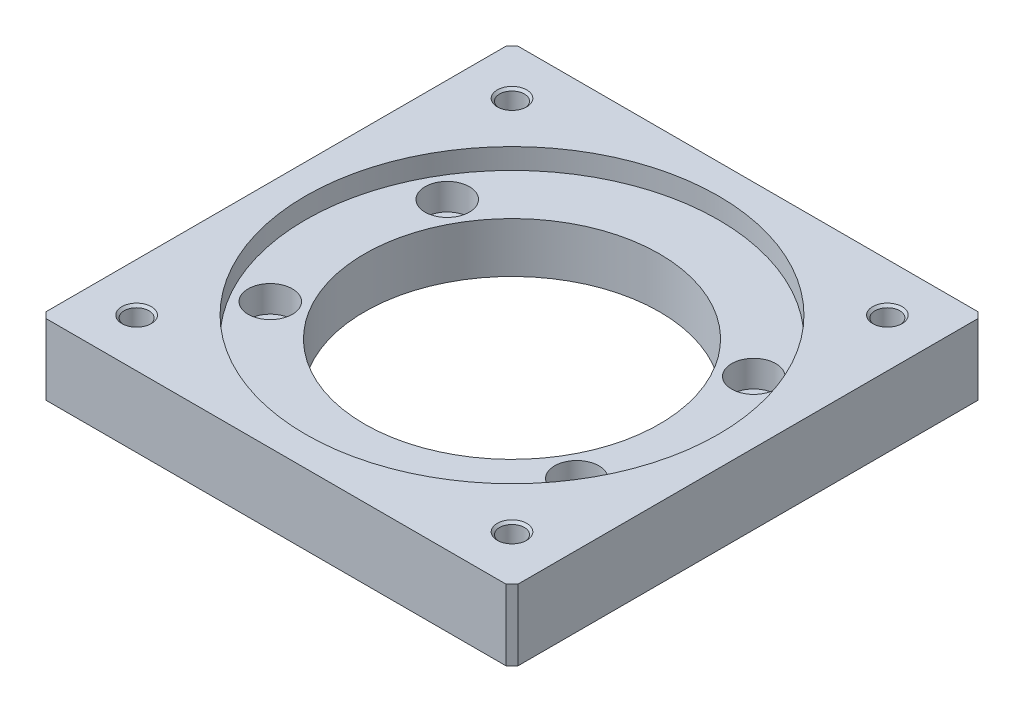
ISO-10303-21;
HEADER;
FILE_DESCRIPTION(('STEP AP214'),'2;1');
FILE_NAME('part.step','',(''),(''),'','','');
FILE_SCHEMA(('AUTOMOTIVE_DESIGN { 1 0 10303 214 1 1 1 1 }'));
ENDSEC;
DATA;
#1=APPLICATION_CONTEXT('core data for automotive mechanical design processes');
#2=APPLICATION_PROTOCOL_DEFINITION('international standard','automotive_design',2000,#1);
#3=PRODUCT_CONTEXT('',#1,'mechanical');
#4=PRODUCT('Part','Part','',(#3));
#5=PRODUCT_RELATED_PRODUCT_CATEGORY('part','',(#4));
#6=PRODUCT_DEFINITION_FORMATION('','',#4);
#7=PRODUCT_DEFINITION_CONTEXT('part definition',#1,'design');
#8=PRODUCT_DEFINITION('design','',#6,#7);
#9=PRODUCT_DEFINITION_SHAPE('','',#8);
#10=(LENGTH_UNIT() NAMED_UNIT(*) SI_UNIT(.MILLI.,.METRE.));
#11=(NAMED_UNIT(*) PLANE_ANGLE_UNIT() SI_UNIT($,.RADIAN.));
#12=(NAMED_UNIT(*) SI_UNIT($,.STERADIAN.) SOLID_ANGLE_UNIT());
#13=UNCERTAINTY_MEASURE_WITH_UNIT(LENGTH_MEASURE(1.E-05),#10,'distance_accuracy_value','');
#14=(GEOMETRIC_REPRESENTATION_CONTEXT(3) GLOBAL_UNCERTAINTY_ASSIGNED_CONTEXT((#13)) GLOBAL_UNIT_ASSIGNED_CONTEXT((#10,
#11,#12)) REPRESENTATION_CONTEXT('',''));
#15=CARTESIAN_POINT('',(0.,0.,0.));
#16=DIRECTION('',(0.,0.,1.));
#17=DIRECTION('',(1.,0.,0.));
#18=AXIS2_PLACEMENT_3D('',#15,#16,#17);
#19=CARTESIAN_POINT('',(-31.81980515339,11.6,31.81980515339));
#20=DIRECTION('',(0.,1.,0.));
#21=DIRECTION('',(0.,0.,1.));
#22=AXIS2_PLACEMENT_3D('',#19,#20,#21);
#23=CONICAL_SURFACE('',#22,2.1,0.785398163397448);
#24=CARTESIAN_POINT('',(-31.81980515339,11.6,31.81980515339));
#25=DIRECTION('',(0.,1.,0.));
#26=DIRECTION('',(1.,0.,0.));
#27=AXIS2_PLACEMENT_3D('',#24,#25,#26);
#28=CIRCLE('',#27,2.1);
#29=CARTESIAN_POINT('',(-29.71980515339,11.6,31.81980515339));
#30=VERTEX_POINT('',#29);
#31=EDGE_CURVE('E181',#30,#30,#28,.F.);
#32=ORIENTED_EDGE('',*,*,#31,.T.);
#33=EDGE_LOOP('',(#32));
#34=FACE_BOUND('',#33,.T.);
#35=CARTESIAN_POINT('',(-31.81980515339,12.,31.81980515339));
#36=DIRECTION('',(0.,1.,0.));
#37=DIRECTION('',(0.,0.,1.));
#38=AXIS2_PLACEMENT_3D('',#35,#36,#37);
#39=CIRCLE('',#38,2.5);
#40=CARTESIAN_POINT('',(-31.81980515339,12.,34.31980515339));
#41=VERTEX_POINT('',#40);
#42=EDGE_CURVE('E188',#41,#41,#39,.T.);
#43=ORIENTED_EDGE('',*,*,#42,.T.);
#44=EDGE_LOOP('',(#43));
#45=FACE_BOUND('',#44,.T.);
#46=ADVANCED_FACE('F16',(#34,#45),#23,.F.);
#47=CARTESIAN_POINT('',(31.81980515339,11.6,31.81980515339));
#48=DIRECTION('',(0.,1.,0.));
#49=DIRECTION('',(0.,0.,1.));
#50=AXIS2_PLACEMENT_3D('',#47,#48,#49);
#51=CONICAL_SURFACE('',#50,2.1,0.785398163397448);
#52=CARTESIAN_POINT('',(31.81980515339,11.6,31.81980515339));
#53=DIRECTION('',(0.,1.,0.));
#54=DIRECTION('',(1.,0.,0.));
#55=AXIS2_PLACEMENT_3D('',#52,#53,#54);
#56=CIRCLE('',#55,2.09999999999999);
#57=CARTESIAN_POINT('',(33.91980515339,11.6,31.81980515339));
#58=VERTEX_POINT('',#57);
#59=EDGE_CURVE('E241',#58,#58,#56,.F.);
#60=ORIENTED_EDGE('',*,*,#59,.T.);
#61=EDGE_LOOP('',(#60));
#62=FACE_BOUND('',#61,.T.);
#63=CARTESIAN_POINT('',(31.81980515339,12.,31.81980515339));
#64=DIRECTION('',(0.,1.,0.));
#65=DIRECTION('',(-1.,0.,0.));
#66=AXIS2_PLACEMENT_3D('',#63,#64,#65);
#67=CIRCLE('',#66,2.5);
#68=CARTESIAN_POINT('',(29.31980515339,12.,31.81980515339));
#69=VERTEX_POINT('',#68);
#70=EDGE_CURVE('E185',#69,#69,#67,.T.);
#71=ORIENTED_EDGE('',*,*,#70,.T.);
#72=EDGE_LOOP('',(#71));
#73=FACE_BOUND('',#72,.T.);
#74=ADVANCED_FACE('F342',(#62,#73),#51,.F.);
#75=CARTESIAN_POINT('',(31.81980515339,11.5999999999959,-31.81980515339));
#76=DIRECTION('',(0.,1.,0.));
#77=DIRECTION('',(0.,0.,1.));
#78=AXIS2_PLACEMENT_3D('',#75,#76,#77);
#79=CONICAL_SURFACE('',#78,2.10000000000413,0.785398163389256);
#80=CARTESIAN_POINT('',(31.81980515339,11.6,-31.81980515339));
#81=DIRECTION('',(0.,1.,0.));
#82=DIRECTION('',(1.,0.,0.));
#83=AXIS2_PLACEMENT_3D('',#80,#81,#82);
#84=CIRCLE('',#83,2.09999999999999);
#85=CARTESIAN_POINT('',(33.91980515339,11.6,-31.81980515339));
#86=VERTEX_POINT('',#85);
#87=EDGE_CURVE('E238',#86,#86,#84,.F.);
#88=ORIENTED_EDGE('',*,*,#87,.T.);
#89=EDGE_LOOP('',(#88));
#90=FACE_BOUND('',#89,.T.);
#91=CARTESIAN_POINT('',(31.81980515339,11.9999999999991,-31.81980515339));
#92=DIRECTION('',(0.,1.,0.));
#93=DIRECTION('',(0.,0.,1.));
#94=AXIS2_PLACEMENT_3D('',#91,#92,#93);
#95=CIRCLE('',#94,2.50000000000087);
#96=CARTESIAN_POINT('',(31.81980515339,11.9999999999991,-29.3198051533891));
#97=VERTEX_POINT('',#96);
#98=EDGE_CURVE('E191',#97,#97,#95,.T.);
#99=ORIENTED_EDGE('',*,*,#98,.T.);
#100=EDGE_LOOP('',(#99));
#101=FACE_BOUND('',#100,.T.);
#102=ADVANCED_FACE('F346',(#90,#101),#79,.F.);
#103=CARTESIAN_POINT('',(-31.81980515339,11.5999999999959,-31.81980515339));
#104=DIRECTION('',(0.,1.,0.));
#105=DIRECTION('',(0.,0.,1.));
#106=AXIS2_PLACEMENT_3D('',#103,#104,#105);
#107=CONICAL_SURFACE('',#106,2.10000000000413,0.785398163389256);
#108=CARTESIAN_POINT('',(-31.81980515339,11.6,-31.81980515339));
#109=DIRECTION('',(0.,1.,0.));
#110=DIRECTION('',(1.,0.,0.));
#111=AXIS2_PLACEMENT_3D('',#108,#109,#110);
#112=CIRCLE('',#111,2.1);
#113=CARTESIAN_POINT('',(-29.71980515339,11.6,-31.81980515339));
#114=VERTEX_POINT('',#113);
#115=EDGE_CURVE('E177',#114,#114,#112,.F.);
#116=ORIENTED_EDGE('',*,*,#115,.T.);
#117=EDGE_LOOP('',(#116));
#118=FACE_BOUND('',#117,.T.);
#119=CARTESIAN_POINT('',(-31.81980515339,11.9999999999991,-31.81980515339));
#120=DIRECTION('',(0.,1.,0.));
#121=DIRECTION('',(-1.,0.,0.));
#122=AXIS2_PLACEMENT_3D('',#119,#120,#121);
#123=CIRCLE('',#122,2.50000000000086);
#124=CARTESIAN_POINT('',(-34.3198051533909,11.9999999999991,-31.81980515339));
#125=VERTEX_POINT('',#124);
#126=EDGE_CURVE('E178',#125,#125,#123,.T.);
#127=ORIENTED_EDGE('',*,*,#126,.T.);
#128=EDGE_LOOP('',(#127));
#129=FACE_BOUND('',#128,.T.);
#130=ADVANCED_FACE('F350',(#118,#129),#107,.F.);
#131=CARTESIAN_POINT('',(0.,8.5,0.));
#132=DIRECTION('',(0.,1.,0.));
#133=DIRECTION('',(0.,0.,1.));
#134=AXIS2_PLACEMENT_3D('',#131,#132,#133);
#135=CYLINDRICAL_SURFACE('',#134,35.);
#136=CARTESIAN_POINT('',(0.,8.5,0.));
#137=DIRECTION('',(0.,1.,0.));
#138=DIRECTION('',(0.,0.,1.));
#139=AXIS2_PLACEMENT_3D('',#136,#137,#138);
#140=CIRCLE('',#139,35.);
#141=CARTESIAN_POINT('',(0.,8.5,35.));
#142=VERTEX_POINT('',#141);
#143=EDGE_CURVE('E162',#142,#142,#140,.F.);
#144=ORIENTED_EDGE('',*,*,#143,.T.);
#145=EDGE_LOOP('',(#144));
#146=FACE_BOUND('',#145,.T.);
#147=CARTESIAN_POINT('',(0.,12.,0.));
#148=DIRECTION('',(0.,1.,0.));
#149=DIRECTION('',(0.,0.,1.));
#150=AXIS2_PLACEMENT_3D('',#147,#148,#149);
#151=CIRCLE('',#150,35.);
#152=CARTESIAN_POINT('',(0.,12.,35.));
#153=VERTEX_POINT('',#152);
#154=EDGE_CURVE('E182',#153,#153,#151,.T.);
#155=ORIENTED_EDGE('',*,*,#154,.T.);
#156=EDGE_LOOP('',(#155));
#157=FACE_BOUND('',#156,.T.);
#158=ADVANCED_FACE('F354',(#146,#157),#135,.F.);
#159=CARTESIAN_POINT('',(25.98076211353,4.,-15.));
#160=DIRECTION('',(0.,1.,0.));
#161=DIRECTION('',(0.,0.,1.));
#162=AXIS2_PLACEMENT_3D('',#159,#160,#161);
#163=CYLINDRICAL_SURFACE('',#162,3.75);
#164=CARTESIAN_POINT('',(25.98076211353,8.5,-15.));
#165=DIRECTION('',(0.,1.,0.));
#166=DIRECTION('',(0.,0.,1.));
#167=AXIS2_PLACEMENT_3D('',#164,#165,#166);
#168=CIRCLE('',#167,3.75);
#169=CARTESIAN_POINT('',(25.98076211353,8.5,-11.25));
#170=VERTEX_POINT('',#169);
#171=EDGE_CURVE('E159',#170,#170,#168,.T.);
#172=ORIENTED_EDGE('',*,*,#171,.T.);
#173=EDGE_LOOP('',(#172));
#174=FACE_BOUND('',#173,.T.);
#175=CARTESIAN_POINT('',(25.98076211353,4.,-15.));
#176=DIRECTION('',(0.,1.,0.));
#177=DIRECTION('',(0.,0.,1.));
#178=AXIS2_PLACEMENT_3D('',#175,#176,#177);
#179=CIRCLE('',#178,3.75);
#180=CARTESIAN_POINT('',(25.98076211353,4.,-11.25));
#181=VERTEX_POINT('',#180);
#182=EDGE_CURVE('E174',#181,#181,#179,.F.);
#183=ORIENTED_EDGE('',*,*,#182,.T.);
#184=EDGE_LOOP('',(#183));
#185=FACE_BOUND('',#184,.T.);
#186=ADVANCED_FACE('F358',(#174,#185),#163,.F.);
#187=CARTESIAN_POINT('',(-25.98076211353,4.,-15.));
#188=DIRECTION('',(0.,1.,0.));
#189=DIRECTION('',(0.,0.,1.));
#190=AXIS2_PLACEMENT_3D('',#187,#188,#189);
#191=CYLINDRICAL_SURFACE('',#190,3.75);
#192=CARTESIAN_POINT('',(-25.98076211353,8.5,-15.));
#193=DIRECTION('',(0.,1.,0.));
#194=DIRECTION('',(0.,0.,1.));
#195=AXIS2_PLACEMENT_3D('',#192,#193,#194);
#196=CIRCLE('',#195,3.75);
#197=CARTESIAN_POINT('',(-25.98076211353,8.5,-11.25));
#198=VERTEX_POINT('',#197);
#199=EDGE_CURVE('E156',#198,#198,#196,.T.);
#200=ORIENTED_EDGE('',*,*,#199,.T.);
#201=EDGE_LOOP('',(#200));
#202=FACE_BOUND('',#201,.T.);
#203=CARTESIAN_POINT('',(-25.98076211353,4.,-15.));
#204=DIRECTION('',(0.,1.,0.));
#205=DIRECTION('',(0.,0.,1.));
#206=AXIS2_PLACEMENT_3D('',#203,#204,#205);
#207=CIRCLE('',#206,3.75);
#208=CARTESIAN_POINT('',(-25.98076211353,4.,-11.25));
#209=VERTEX_POINT('',#208);
#210=EDGE_CURVE('E168',#209,#209,#207,.F.);
#211=ORIENTED_EDGE('',*,*,#210,.T.);
#212=EDGE_LOOP('',(#211));
#213=FACE_BOUND('',#212,.T.);
#214=ADVANCED_FACE('F362',(#202,#213),#191,.F.);
#215=CARTESIAN_POINT('',(-25.98076211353,4.,15.));
#216=DIRECTION('',(0.,1.,0.));
#217=DIRECTION('',(0.,0.,1.));
#218=AXIS2_PLACEMENT_3D('',#215,#216,#217);
#219=CYLINDRICAL_SURFACE('',#218,3.75);
#220=CARTESIAN_POINT('',(-25.98076211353,8.5,15.));
#221=DIRECTION('',(0.,1.,0.));
#222=DIRECTION('',(0.,0.,1.));
#223=AXIS2_PLACEMENT_3D('',#220,#221,#222);
#224=CIRCLE('',#223,3.75);
#225=CARTESIAN_POINT('',(-25.98076211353,8.5,18.75));
#226=VERTEX_POINT('',#225);
#227=EDGE_CURVE('E104',#226,#226,#224,.T.);
#228=ORIENTED_EDGE('',*,*,#227,.T.);
#229=EDGE_LOOP('',(#228));
#230=FACE_BOUND('',#229,.T.);
#231=CARTESIAN_POINT('',(-25.98076211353,4.,15.));
#232=DIRECTION('',(0.,1.,0.));
#233=DIRECTION('',(0.,0.,1.));
#234=AXIS2_PLACEMENT_3D('',#231,#232,#233);
#235=CIRCLE('',#234,3.75);
#236=CARTESIAN_POINT('',(-25.98076211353,4.,18.75));
#237=VERTEX_POINT('',#236);
#238=EDGE_CURVE('E165',#237,#237,#235,.F.);
#239=ORIENTED_EDGE('',*,*,#238,.T.);
#240=EDGE_LOOP('',(#239));
#241=FACE_BOUND('',#240,.T.);
#242=ADVANCED_FACE('F366',(#230,#241),#219,.F.);
#243=CARTESIAN_POINT('',(25.98076211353,4.,15.));
#244=DIRECTION('',(0.,1.,0.));
#245=DIRECTION('',(0.,0.,1.));
#246=AXIS2_PLACEMENT_3D('',#243,#244,#245);
#247=CYLINDRICAL_SURFACE('',#246,3.75);
#248=CARTESIAN_POINT('',(25.98076211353,8.5,15.));
#249=DIRECTION('',(0.,1.,0.));
#250=DIRECTION('',(0.,0.,1.));
#251=AXIS2_PLACEMENT_3D('',#248,#249,#250);
#252=CIRCLE('',#251,3.75);
#253=CARTESIAN_POINT('',(25.98076211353,8.5,18.75));
#254=VERTEX_POINT('',#253);
#255=EDGE_CURVE('E101',#254,#254,#252,.T.);
#256=ORIENTED_EDGE('',*,*,#255,.T.);
#257=EDGE_LOOP('',(#256));
#258=FACE_BOUND('',#257,.T.);
#259=CARTESIAN_POINT('',(25.98076211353,4.,15.));
#260=DIRECTION('',(0.,1.,0.));
#261=DIRECTION('',(0.,0.,1.));
#262=AXIS2_PLACEMENT_3D('',#259,#260,#261);
#263=CIRCLE('',#262,3.75);
#264=CARTESIAN_POINT('',(25.98076211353,4.,18.75));
#265=VERTEX_POINT('',#264);
#266=EDGE_CURVE('E171',#265,#265,#263,.F.);
#267=ORIENTED_EDGE('',*,*,#266,.T.);
#268=EDGE_LOOP('',(#267));
#269=FACE_BOUND('',#268,.T.);
#270=ADVANCED_FACE('F339',(#258,#269),#247,.F.);
#271=CARTESIAN_POINT('',(-40.1056,12.24,-38.8944));
#272=DIRECTION('',(-0.707106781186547,0.,-0.707106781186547));
#273=DIRECTION('',(0.707106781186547,0.,-0.707106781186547));
#274=AXIS2_PLACEMENT_3D('',#271,#272,#273);
#275=PLANE('',#274);
#276=DIRECTION('',(0.707106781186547,0.,-0.707106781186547));
#277=VECTOR('',#276,1.);
#278=CARTESIAN_POINT('',(-40.1056,12.,-38.8944));
#279=LINE('',#278,#277);
#280=CARTESIAN_POINT('',(-40.,12.,-39.));
#281=VERTEX_POINT('',#280);
#282=CARTESIAN_POINT('',(-39.,12.,-40.));
#283=VERTEX_POINT('',#282);
#284=EDGE_CURVE('E194',#281,#283,#279,.T.);
#285=ORIENTED_EDGE('',*,*,#284,.T.);
#286=DIRECTION('',(0.,1.,0.));
#287=VECTOR('',#286,1.);
#288=CARTESIAN_POINT('',(-39.,6.,-40.));
#289=LINE('',#288,#287);
#290=CARTESIAN_POINT('',(-39.,0.,-40.));
#291=VERTEX_POINT('',#290);
#292=EDGE_CURVE('E97',#283,#291,#289,.F.);
#293=ORIENTED_EDGE('',*,*,#292,.T.);
#294=DIRECTION('',(-0.707106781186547,0.,0.707106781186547));
#295=VECTOR('',#294,1.);
#296=CARTESIAN_POINT('',(-39.5,0.,-39.5));
#297=LINE('',#296,#295);
#298=CARTESIAN_POINT('',(-40.,0.,-39.));
#299=VERTEX_POINT('',#298);
#300=EDGE_CURVE('E234',#299,#291,#297,.F.);
#301=ORIENTED_EDGE('',*,*,#300,.F.);
#302=DIRECTION('',(0.,-1.,0.));
#303=VECTOR('',#302,1.);
#304=CARTESIAN_POINT('',(-40.,6.,-39.));
#305=LINE('',#304,#303);
#306=EDGE_CURVE('E247',#299,#281,#305,.F.);
#307=ORIENTED_EDGE('',*,*,#306,.T.);
#308=EDGE_LOOP('',(#285,#293,#301,#307));
#309=FACE_BOUND('',#308,.T.);
#310=ADVANCED_FACE('F250',(#309),#275,.T.);
#311=CARTESIAN_POINT('',(-38.8944,12.24,40.1056));
#312=DIRECTION('',(-0.707106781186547,0.,0.707106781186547));
#313=DIRECTION('',(-0.707106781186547,0.,-0.707106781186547));
#314=AXIS2_PLACEMENT_3D('',#311,#312,#313);
#315=PLANE('',#314);
#316=DIRECTION('',(-0.707106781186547,0.,-0.707106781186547));
#317=VECTOR('',#316,1.);
#318=CARTESIAN_POINT('',(-38.8944,12.,40.1056));
#319=LINE('',#318,#317);
#320=CARTESIAN_POINT('',(-39.,12.,40.));
#321=VERTEX_POINT('',#320);
#322=CARTESIAN_POINT('',(-40.,12.,39.));
#323=VERTEX_POINT('',#322);
#324=EDGE_CURVE('E196',#321,#323,#319,.T.);
#325=ORIENTED_EDGE('',*,*,#324,.T.);
#326=DIRECTION('',(0.,1.,0.));
#327=VECTOR('',#326,1.);
#328=CARTESIAN_POINT('',(-40.,6.,39.));
#329=LINE('',#328,#327);
#330=CARTESIAN_POINT('',(-40.,0.,39.));
#331=VERTEX_POINT('',#330);
#332=EDGE_CURVE('E212',#323,#331,#329,.F.);
#333=ORIENTED_EDGE('',*,*,#332,.T.);
#334=DIRECTION('',(0.707106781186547,0.,0.707106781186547));
#335=VECTOR('',#334,1.);
#336=CARTESIAN_POINT('',(-39.5,0.,39.5));
#337=LINE('',#336,#335);
#338=CARTESIAN_POINT('',(-39.,0.,40.));
#339=VERTEX_POINT('',#338);
#340=EDGE_CURVE('E232',#339,#331,#337,.F.);
#341=ORIENTED_EDGE('',*,*,#340,.F.);
#342=DIRECTION('',(0.,-1.,0.));
#343=VECTOR('',#342,1.);
#344=CARTESIAN_POINT('',(-39.,6.,40.));
#345=LINE('',#344,#343);
#346=EDGE_CURVE('E210',#339,#321,#345,.F.);
#347=ORIENTED_EDGE('',*,*,#346,.T.);
#348=EDGE_LOOP('',(#325,#333,#341,#347));
#349=FACE_BOUND('',#348,.T.);
#350=ADVANCED_FACE('F333',(#349),#315,.T.);
#351=CARTESIAN_POINT('',(38.8944,12.24,-40.1056));
#352=DIRECTION('',(0.707106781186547,0.,-0.707106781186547));
#353=DIRECTION('',(0.707106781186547,0.,0.707106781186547));
#354=AXIS2_PLACEMENT_3D('',#351,#352,#353);
#355=PLANE('',#354);
#356=DIRECTION('',(0.707106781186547,0.,0.707106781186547));
#357=VECTOR('',#356,1.);
#358=CARTESIAN_POINT('',(38.8944,12.,-40.1056));
#359=LINE('',#358,#357);
#360=CARTESIAN_POINT('',(39.,12.,-40.));
#361=VERTEX_POINT('',#360);
#362=CARTESIAN_POINT('',(40.,12.,-39.));
#363=VERTEX_POINT('',#362);
#364=EDGE_CURVE('E20',#361,#363,#359,.T.);
#365=ORIENTED_EDGE('',*,*,#364,.T.);
#366=DIRECTION('',(0.,1.,0.));
#367=VECTOR('',#366,1.);
#368=CARTESIAN_POINT('',(40.,6.,-39.));
#369=LINE('',#368,#367);
#370=CARTESIAN_POINT('',(40.,0.,-39.));
#371=VERTEX_POINT('',#370);
#372=EDGE_CURVE('E110',#363,#371,#369,.F.);
#373=ORIENTED_EDGE('',*,*,#372,.T.);
#374=DIRECTION('',(-0.707106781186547,0.,-0.707106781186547));
#375=VECTOR('',#374,1.);
#376=CARTESIAN_POINT('',(39.5,0.,-39.5));
#377=LINE('',#376,#375);
#378=CARTESIAN_POINT('',(39.,0.,-40.));
#379=VERTEX_POINT('',#378);
#380=EDGE_CURVE('E100',#379,#371,#377,.F.);
#381=ORIENTED_EDGE('',*,*,#380,.F.);
#382=DIRECTION('',(0.,-1.,0.));
#383=VECTOR('',#382,1.);
#384=CARTESIAN_POINT('',(39.,6.,-40.));
#385=LINE('',#384,#383);
#386=EDGE_CURVE('E94',#379,#361,#385,.F.);
#387=ORIENTED_EDGE('',*,*,#386,.T.);
#388=EDGE_LOOP('',(#365,#373,#381,#387));
#389=FACE_BOUND('',#388,.T.);
#390=ADVANCED_FACE('F99',(#389),#355,.T.);
#391=CARTESIAN_POINT('',(40.1056,12.24,38.8944));
#392=DIRECTION('',(0.707106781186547,0.,0.707106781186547));
#393=DIRECTION('',(-0.707106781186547,0.,0.707106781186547));
#394=AXIS2_PLACEMENT_3D('',#391,#392,#393);
#395=PLANE('',#394);
#396=DIRECTION('',(-0.707106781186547,0.,0.707106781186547));
#397=VECTOR('',#396,1.);
#398=CARTESIAN_POINT('',(40.1056,12.,38.8944));
#399=LINE('',#398,#397);
#400=CARTESIAN_POINT('',(40.,12.,39.));
#401=VERTEX_POINT('',#400);
#402=CARTESIAN_POINT('',(39.,12.,40.));
#403=VERTEX_POINT('',#402);
#404=EDGE_CURVE('E88',#401,#403,#399,.T.);
#405=ORIENTED_EDGE('',*,*,#404,.T.);
#406=DIRECTION('',(0.,1.,0.));
#407=VECTOR('',#406,1.);
#408=CARTESIAN_POINT('',(39.,6.,40.));
#409=LINE('',#408,#407);
#410=CARTESIAN_POINT('',(39.,0.,40.));
#411=VERTEX_POINT('',#410);
#412=EDGE_CURVE('E108',#403,#411,#409,.F.);
#413=ORIENTED_EDGE('',*,*,#412,.T.);
#414=DIRECTION('',(0.707106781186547,0.,-0.707106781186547));
#415=VECTOR('',#414,1.);
#416=CARTESIAN_POINT('',(39.5,0.,39.5));
#417=LINE('',#416,#415);
#418=CARTESIAN_POINT('',(40.,0.,39.));
#419=VERTEX_POINT('',#418);
#420=EDGE_CURVE('E35',#419,#411,#417,.F.);
#421=ORIENTED_EDGE('',*,*,#420,.F.);
#422=DIRECTION('',(0.,-1.,0.));
#423=VECTOR('',#422,1.);
#424=CARTESIAN_POINT('',(40.,6.,39.));
#425=LINE('',#424,#423);
#426=EDGE_CURVE('E111',#419,#401,#425,.F.);
#427=ORIENTED_EDGE('',*,*,#426,.T.);
#428=EDGE_LOOP('',(#405,#413,#421,#427));
#429=FACE_BOUND('',#428,.T.);
#430=ADVANCED_FACE('F198',(#429),#395,.T.);
#431=CARTESIAN_POINT('',(-41.6,12.,41.6));
#432=DIRECTION('',(0.,1.,0.));
#433=DIRECTION('',(1.,0.,0.));
#434=AXIS2_PLACEMENT_3D('',#431,#432,#433);
#435=PLANE('',#434);
#436=ORIENTED_EDGE('',*,*,#126,.F.);
#437=EDGE_LOOP('',(#436));
#438=FACE_BOUND('',#437,.T.);
#439=ORIENTED_EDGE('',*,*,#154,.F.);
#440=EDGE_LOOP('',(#439));
#441=FACE_BOUND('',#440,.T.);
#442=ORIENTED_EDGE('',*,*,#70,.F.);
#443=EDGE_LOOP('',(#442));
#444=FACE_BOUND('',#443,.T.);
#445=ORIENTED_EDGE('',*,*,#42,.F.);
#446=EDGE_LOOP('',(#445));
#447=FACE_BOUND('',#446,.T.);
#448=ORIENTED_EDGE('',*,*,#98,.F.);
#449=EDGE_LOOP('',(#448));
#450=FACE_BOUND('',#449,.T.);
#451=ORIENTED_EDGE('',*,*,#284,.F.);
#452=DIRECTION('',(0.,0.,-1.));
#453=VECTOR('',#452,1.);
#454=CARTESIAN_POINT('',(-40.,12.,0.));
#455=LINE('',#454,#453);
#456=EDGE_CURVE('E218',#281,#323,#455,.F.);
#457=ORIENTED_EDGE('',*,*,#456,.T.);
#458=ORIENTED_EDGE('',*,*,#324,.F.);
#459=DIRECTION('',(-1.,0.,0.));
#460=VECTOR('',#459,1.);
#461=CARTESIAN_POINT('',(0.,12.,40.));
#462=LINE('',#461,#460);
#463=EDGE_CURVE('E205',#321,#403,#462,.F.);
#464=ORIENTED_EDGE('',*,*,#463,.T.);
#465=ORIENTED_EDGE('',*,*,#404,.F.);
#466=DIRECTION('',(0.,0.,1.));
#467=VECTOR('',#466,1.);
#468=CARTESIAN_POINT('',(40.,12.,0.));
#469=LINE('',#468,#467);
#470=EDGE_CURVE('E84',#401,#363,#469,.F.);
#471=ORIENTED_EDGE('',*,*,#470,.T.);
#472=ORIENTED_EDGE('',*,*,#364,.F.);
#473=DIRECTION('',(1.,0.,0.));
#474=VECTOR('',#473,1.);
#475=CARTESIAN_POINT('',(0.,12.,-40.));
#476=LINE('',#475,#474);
#477=EDGE_CURVE('E82',#361,#283,#476,.F.);
#478=ORIENTED_EDGE('',*,*,#477,.T.);
#479=EDGE_LOOP('',(#451,#457,#458,#464,#465,#471,#472,#478));
#480=FACE_BOUND('',#479,.T.);
#481=ADVANCED_FACE('F81',(#438,#441,#444,#447,#450,#480),#435,.T.);
#482=CARTESIAN_POINT('',(-31.81980515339,0.399999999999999,31.81980515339));
#483=DIRECTION('',(0.,1.,0.));
#484=DIRECTION('',(0.,0.,1.));
#485=AXIS2_PLACEMENT_3D('',#482,#483,#484);
#486=CYLINDRICAL_SURFACE('',#485,2.1);
#487=CARTESIAN_POINT('',(-31.81980515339,0.399999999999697,31.81980515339));
#488=DIRECTION('',(0.,-1.,0.));
#489=DIRECTION('',(0.,0.,-1.));
#490=AXIS2_PLACEMENT_3D('',#487,#488,#489);
#491=CIRCLE('',#490,2.0999999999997);
#492=CARTESIAN_POINT('',(-31.81980515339,0.399999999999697,29.7198051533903));
#493=VERTEX_POINT('',#492);
#494=EDGE_CURVE('E219',#493,#493,#491,.T.);
#495=ORIENTED_EDGE('',*,*,#494,.T.);
#496=EDGE_LOOP('',(#495));
#497=FACE_BOUND('',#496,.T.);
#498=ORIENTED_EDGE('',*,*,#31,.F.);
#499=EDGE_LOOP('',(#498));
#500=FACE_BOUND('',#499,.T.);
#501=ADVANCED_FACE('F327',(#497,#500),#486,.F.);
#502=CARTESIAN_POINT('',(31.81980515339,0.399999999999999,31.81980515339));
#503=DIRECTION('',(0.,1.,0.));
#504=DIRECTION('',(0.,0.,1.));
#505=AXIS2_PLACEMENT_3D('',#502,#503,#504);
#506=CYLINDRICAL_SURFACE('',#505,2.09999999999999);
#507=CARTESIAN_POINT('',(31.81980515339,0.399999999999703,31.81980515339));
#508=DIRECTION('',(0.,-1.,0.));
#509=DIRECTION('',(0.,0.,-1.));
#510=AXIS2_PLACEMENT_3D('',#507,#508,#509);
#511=CIRCLE('',#510,2.0999999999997);
#512=CARTESIAN_POINT('',(31.81980515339,0.399999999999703,29.7198051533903));
#513=VERTEX_POINT('',#512);
#514=EDGE_CURVE('E221',#513,#513,#511,.T.);
#515=ORIENTED_EDGE('',*,*,#514,.T.);
#516=EDGE_LOOP('',(#515));
#517=FACE_BOUND('',#516,.T.);
#518=ORIENTED_EDGE('',*,*,#59,.F.);
#519=EDGE_LOOP('',(#518));
#520=FACE_BOUND('',#519,.T.);
#521=ADVANCED_FACE('F376',(#517,#520),#506,.F.);
#522=CARTESIAN_POINT('',(31.81980515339,0.399999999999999,-31.81980515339));
#523=DIRECTION('',(0.,1.,0.));
#524=DIRECTION('',(0.,0.,1.));
#525=AXIS2_PLACEMENT_3D('',#522,#523,#524);
#526=CYLINDRICAL_SURFACE('',#525,2.09999999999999);
#527=CARTESIAN_POINT('',(31.81980515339,0.400000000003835,-31.81980515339));
#528=DIRECTION('',(0.,-1.,0.));
#529=DIRECTION('',(0.,0.,-1.));
#530=AXIS2_PLACEMENT_3D('',#527,#528,#529);
#531=CIRCLE('',#530,2.10000000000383);
#532=CARTESIAN_POINT('',(31.81980515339,0.400000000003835,-33.9198051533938));
#533=VERTEX_POINT('',#532);
#534=EDGE_CURVE('E226',#533,#533,#531,.T.);
#535=ORIENTED_EDGE('',*,*,#534,.T.);
#536=EDGE_LOOP('',(#535));
#537=FACE_BOUND('',#536,.T.);
#538=ORIENTED_EDGE('',*,*,#87,.F.);
#539=EDGE_LOOP('',(#538));
#540=FACE_BOUND('',#539,.T.);
#541=ADVANCED_FACE('F263',(#537,#540),#526,.F.);
#542=CARTESIAN_POINT('',(-31.81980515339,0.399999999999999,-31.81980515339));
#543=DIRECTION('',(0.,1.,0.));
#544=DIRECTION('',(0.,0.,1.));
#545=AXIS2_PLACEMENT_3D('',#542,#543,#544);
#546=CYLINDRICAL_SURFACE('',#545,2.1);
#547=CARTESIAN_POINT('',(-31.81980515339,0.400000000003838,-31.81980515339));
#548=DIRECTION('',(0.,-1.,0.));
#549=DIRECTION('',(0.,0.,-1.));
#550=AXIS2_PLACEMENT_3D('',#547,#548,#549);
#551=CIRCLE('',#550,2.10000000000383);
#552=CARTESIAN_POINT('',(-31.81980515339,0.400000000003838,-33.9198051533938));
#553=VERTEX_POINT('',#552);
#554=EDGE_CURVE('E152',#553,#553,#551,.T.);
#555=ORIENTED_EDGE('',*,*,#554,.T.);
#556=EDGE_LOOP('',(#555));
#557=FACE_BOUND('',#556,.T.);
#558=ORIENTED_EDGE('',*,*,#115,.F.);
#559=EDGE_LOOP('',(#558));
#560=FACE_BOUND('',#559,.T.);
#561=ADVANCED_FACE('F323',(#557,#560),#546,.F.);
#562=CARTESIAN_POINT('',(-30.91999259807,4.,19.5));
#563=DIRECTION('',(0.,1.,0.));
#564=DIRECTION('',(1.,0.,0.));
#565=AXIS2_PLACEMENT_3D('',#562,#563,#564);
#566=PLANE('',#565);
#567=CARTESIAN_POINT('',(25.98076211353,4.,-15.));
#568=DIRECTION('',(0.,1.,0.));
#569=DIRECTION('',(0.,0.,1.));
#570=AXIS2_PLACEMENT_3D('',#567,#568,#569);
#571=CIRCLE('',#570,2.25);
#572=CARTESIAN_POINT('',(25.98076211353,4.,-12.75));
#573=VERTEX_POINT('',#572);
#574=EDGE_CURVE('E150',#573,#573,#571,.F.);
#575=ORIENTED_EDGE('',*,*,#574,.T.);
#576=EDGE_LOOP('',(#575));
#577=FACE_BOUND('',#576,.T.);
#578=ORIENTED_EDGE('',*,*,#182,.F.);
#579=EDGE_LOOP('',(#578));
#580=FACE_BOUND('',#579,.T.);
#581=ADVANCED_FACE('F319',(#577,#580),#566,.T.);
#582=CARTESIAN_POINT('',(-30.91999259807,4.,19.5));
#583=DIRECTION('',(0.,1.,0.));
#584=DIRECTION('',(1.,0.,0.));
#585=AXIS2_PLACEMENT_3D('',#582,#583,#584);
#586=PLANE('',#585);
#587=CARTESIAN_POINT('',(25.98076211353,4.,15.));
#588=DIRECTION('',(0.,1.,0.));
#589=DIRECTION('',(0.,0.,1.));
#590=AXIS2_PLACEMENT_3D('',#587,#588,#589);
#591=CIRCLE('',#590,2.25);
#592=CARTESIAN_POINT('',(25.98076211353,4.,17.25));
#593=VERTEX_POINT('',#592);
#594=EDGE_CURVE('E147',#593,#593,#591,.F.);
#595=ORIENTED_EDGE('',*,*,#594,.T.);
#596=EDGE_LOOP('',(#595));
#597=FACE_BOUND('',#596,.T.);
#598=ORIENTED_EDGE('',*,*,#266,.F.);
#599=EDGE_LOOP('',(#598));
#600=FACE_BOUND('',#599,.T.);
#601=ADVANCED_FACE('F315',(#597,#600),#586,.T.);
#602=CARTESIAN_POINT('',(-30.91999259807,4.,19.5));
#603=DIRECTION('',(0.,1.,0.));
#604=DIRECTION('',(1.,0.,0.));
#605=AXIS2_PLACEMENT_3D('',#602,#603,#604);
#606=PLANE('',#605);
#607=CARTESIAN_POINT('',(-25.98076211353,4.,-15.));
#608=DIRECTION('',(0.,1.,0.));
#609=DIRECTION('',(0.,0.,1.));
#610=AXIS2_PLACEMENT_3D('',#607,#608,#609);
#611=CIRCLE('',#610,2.25);
#612=CARTESIAN_POINT('',(-25.98076211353,4.,-12.75));
#613=VERTEX_POINT('',#612);
#614=EDGE_CURVE('E144',#613,#613,#611,.F.);
#615=ORIENTED_EDGE('',*,*,#614,.T.);
#616=EDGE_LOOP('',(#615));
#617=FACE_BOUND('',#616,.T.);
#618=ORIENTED_EDGE('',*,*,#210,.F.);
#619=EDGE_LOOP('',(#618));
#620=FACE_BOUND('',#619,.T.);
#621=ADVANCED_FACE('F311',(#617,#620),#606,.T.);
#622=CARTESIAN_POINT('',(-30.91999259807,4.,19.5));
#623=DIRECTION('',(0.,1.,0.));
#624=DIRECTION('',(1.,0.,0.));
#625=AXIS2_PLACEMENT_3D('',#622,#623,#624);
#626=PLANE('',#625);
#627=CARTESIAN_POINT('',(-25.98076211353,4.,15.));
#628=DIRECTION('',(0.,1.,0.));
#629=DIRECTION('',(0.,0.,1.));
#630=AXIS2_PLACEMENT_3D('',#627,#628,#629);
#631=CIRCLE('',#630,2.25);
#632=CARTESIAN_POINT('',(-25.98076211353,4.,17.25));
#633=VERTEX_POINT('',#632);
#634=EDGE_CURVE('E141',#633,#633,#631,.F.);
#635=ORIENTED_EDGE('',*,*,#634,.T.);
#636=EDGE_LOOP('',(#635));
#637=FACE_BOUND('',#636,.T.);
#638=ORIENTED_EDGE('',*,*,#238,.F.);
#639=EDGE_LOOP('',(#638));
#640=FACE_BOUND('',#639,.T.);
#641=ADVANCED_FACE('F307',(#637,#640),#626,.T.);
#642=CARTESIAN_POINT('',(-36.4,8.5,36.42998007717));
#643=DIRECTION('',(0.,1.,0.));
#644=DIRECTION('',(1.,0.,0.));
#645=AXIS2_PLACEMENT_3D('',#642,#643,#644);
#646=PLANE('',#645);
#647=ORIENTED_EDGE('',*,*,#255,.F.);
#648=EDGE_LOOP('',(#647));
#649=FACE_BOUND('',#648,.T.);
#650=ORIENTED_EDGE('',*,*,#227,.F.);
#651=EDGE_LOOP('',(#650));
#652=FACE_BOUND('',#651,.T.);
#653=ORIENTED_EDGE('',*,*,#199,.F.);
#654=EDGE_LOOP('',(#653));
#655=FACE_BOUND('',#654,.T.);
#656=ORIENTED_EDGE('',*,*,#171,.F.);
#657=EDGE_LOOP('',(#656));
#658=FACE_BOUND('',#657,.T.);
#659=CARTESIAN_POINT('',(0.,8.5,0.));
#660=DIRECTION('',(0.,1.,0.));
#661=DIRECTION('',(0.,0.,1.));
#662=AXIS2_PLACEMENT_3D('',#659,#660,#661);
#663=CIRCLE('',#662,25.);
#664=CARTESIAN_POINT('',(0.,8.5,25.));
#665=VERTEX_POINT('',#664);
#666=EDGE_CURVE('E137',#665,#665,#663,.F.);
#667=ORIENTED_EDGE('',*,*,#666,.T.);
#668=EDGE_LOOP('',(#667));
#669=FACE_BOUND('',#668,.T.);
#670=ORIENTED_EDGE('',*,*,#143,.F.);
#671=EDGE_LOOP('',(#670));
#672=FACE_BOUND('',#671,.T.);
#673=ADVANCED_FACE('F304',(#649,#652,#655,#658,#669,#672),#646,.T.);
#674=CARTESIAN_POINT('',(40.56,-0.24,-40.));
#675=DIRECTION('',(0.,0.,-1.));
#676=DIRECTION('',(-1.,0.,0.));
#677=AXIS2_PLACEMENT_3D('',#674,#675,#676);
#678=PLANE('',#677);
#679=ORIENTED_EDGE('',*,*,#292,.F.);
#680=ORIENTED_EDGE('',*,*,#477,.F.);
#681=ORIENTED_EDGE('',*,*,#386,.F.);
#682=DIRECTION('',(-1.,0.,0.));
#683=VECTOR('',#682,1.);
#684=CARTESIAN_POINT('',(0.,0.,-40.));
#685=LINE('',#684,#683);
#686=EDGE_CURVE('E140',#379,#291,#685,.T.);
#687=ORIENTED_EDGE('',*,*,#686,.T.);
#688=EDGE_LOOP('',(#679,#680,#681,#687));
#689=FACE_BOUND('',#688,.T.);
#690=ADVANCED_FACE('F92',(#689),#678,.T.);
#691=CARTESIAN_POINT('',(-40.,-0.24,-40.56));
#692=DIRECTION('',(-1.,0.,0.));
#693=DIRECTION('',(0.,0.,1.));
#694=AXIS2_PLACEMENT_3D('',#691,#692,#693);
#695=PLANE('',#694);
#696=ORIENTED_EDGE('',*,*,#332,.F.);
#697=ORIENTED_EDGE('',*,*,#456,.F.);
#698=ORIENTED_EDGE('',*,*,#306,.F.);
#699=DIRECTION('',(0.,0.,1.));
#700=VECTOR('',#699,1.);
#701=CARTESIAN_POINT('',(-40.,0.,0.));
#702=LINE('',#701,#700);
#703=EDGE_CURVE('E253',#299,#331,#702,.T.);
#704=ORIENTED_EDGE('',*,*,#703,.T.);
#705=EDGE_LOOP('',(#696,#697,#698,#704));
#706=FACE_BOUND('',#705,.T.);
#707=ADVANCED_FACE('F296',(#706),#695,.T.);
#708=CARTESIAN_POINT('',(-40.56,-0.24,40.));
#709=DIRECTION('',(0.,0.,1.));
#710=DIRECTION('',(1.,0.,0.));
#711=AXIS2_PLACEMENT_3D('',#708,#709,#710);
#712=PLANE('',#711);
#713=ORIENTED_EDGE('',*,*,#412,.F.);
#714=ORIENTED_EDGE('',*,*,#463,.F.);
#715=ORIENTED_EDGE('',*,*,#346,.F.);
#716=DIRECTION('',(1.,0.,0.));
#717=VECTOR('',#716,1.);
#718=CARTESIAN_POINT('',(0.,0.,40.));
#719=LINE('',#718,#717);
#720=EDGE_CURVE('E208',#339,#411,#719,.T.);
#721=ORIENTED_EDGE('',*,*,#720,.T.);
#722=EDGE_LOOP('',(#713,#714,#715,#721));
#723=FACE_BOUND('',#722,.T.);
#724=ADVANCED_FACE('F203',(#723),#712,.T.);
#725=CARTESIAN_POINT('',(40.,-0.24,40.56));
#726=DIRECTION('',(1.,0.,0.));
#727=DIRECTION('',(0.,0.,-1.));
#728=AXIS2_PLACEMENT_3D('',#725,#726,#727);
#729=PLANE('',#728);
#730=ORIENTED_EDGE('',*,*,#426,.F.);
#731=DIRECTION('',(0.,0.,-1.));
#732=VECTOR('',#731,1.);
#733=CARTESIAN_POINT('',(40.,0.,0.));
#734=LINE('',#733,#732);
#735=EDGE_CURVE('E136',#419,#371,#734,.T.);
#736=ORIENTED_EDGE('',*,*,#735,.T.);
#737=ORIENTED_EDGE('',*,*,#372,.F.);
#738=ORIENTED_EDGE('',*,*,#470,.F.);
#739=EDGE_LOOP('',(#730,#736,#737,#738));
#740=FACE_BOUND('',#739,.T.);
#741=ADVANCED_FACE('F286',(#740),#729,.T.);
#742=CARTESIAN_POINT('',(-31.81980515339,0.399999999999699,31.81980515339));
#743=DIRECTION('',(0.,-1.,0.));
#744=DIRECTION('',(0.,0.,-1.));
#745=AXIS2_PLACEMENT_3D('',#742,#743,#744);
#746=CONICAL_SURFACE('',#745,2.09999999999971,0.785398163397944);
#747=ORIENTED_EDGE('',*,*,#494,.F.);
#748=EDGE_LOOP('',(#747));
#749=FACE_BOUND('',#748,.T.);
#750=CARTESIAN_POINT('',(-31.81980515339,0.,31.81980515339));
#751=DIRECTION('',(0.,-1.,0.));
#752=DIRECTION('',(1.,0.,0.));
#753=AXIS2_PLACEMENT_3D('',#750,#751,#752);
#754=CIRCLE('',#753,2.49999999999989);
#755=CARTESIAN_POINT('',(-29.3198051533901,0.,31.81980515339));
#756=VERTEX_POINT('',#755);
#757=EDGE_CURVE('E133',#756,#756,#754,.T.);
#758=ORIENTED_EDGE('',*,*,#757,.T.);
#759=EDGE_LOOP('',(#758));
#760=FACE_BOUND('',#759,.T.);
#761=ADVANCED_FACE('F288',(#749,#760),#746,.F.);
#762=CARTESIAN_POINT('',(31.81980515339,0.399999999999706,31.81980515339));
#763=DIRECTION('',(0.,-1.,0.));
#764=DIRECTION('',(0.,0.,-1.));
#765=AXIS2_PLACEMENT_3D('',#762,#763,#764);
#766=CONICAL_SURFACE('',#765,2.0999999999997,0.785398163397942);
#767=ORIENTED_EDGE('',*,*,#514,.F.);
#768=EDGE_LOOP('',(#767));
#769=FACE_BOUND('',#768,.T.);
#770=CARTESIAN_POINT('',(31.81980515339,0.,31.81980515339));
#771=DIRECTION('',(0.,-1.,0.));
#772=DIRECTION('',(0.,0.,-1.));
#773=AXIS2_PLACEMENT_3D('',#770,#771,#772);
#774=CIRCLE('',#773,2.4999999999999);
#775=CARTESIAN_POINT('',(31.81980515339,0.,29.3198051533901));
#776=VERTEX_POINT('',#775);
#777=EDGE_CURVE('E130',#776,#776,#774,.T.);
#778=ORIENTED_EDGE('',*,*,#777,.T.);
#779=EDGE_LOOP('',(#778));
#780=FACE_BOUND('',#779,.T.);
#781=ADVANCED_FACE('F270',(#769,#780),#766,.F.);
#782=CARTESIAN_POINT('',(31.81980515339,0.400000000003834,-31.81980515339));
#783=DIRECTION('',(0.,-1.,0.));
#784=DIRECTION('',(1.,0.,0.));
#785=AXIS2_PLACEMENT_3D('',#782,#783,#784);
#786=CONICAL_SURFACE('',#785,2.10000000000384,0.785398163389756);
#787=ORIENTED_EDGE('',*,*,#534,.F.);
#788=EDGE_LOOP('',(#787));
#789=FACE_BOUND('',#788,.T.);
#790=CARTESIAN_POINT('',(31.81980515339,7.5764047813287E-13,-31.81980515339));
#791=DIRECTION('',(0.,-1.,0.));
#792=DIRECTION('',(0.,0.,-1.));
#793=AXIS2_PLACEMENT_3D('',#790,#791,#792);
#794=CIRCLE('',#793,2.50000000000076);
#795=CARTESIAN_POINT('',(31.81980515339,7.5764047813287E-13,-34.3198051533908));
#796=VERTEX_POINT('',#795);
#797=EDGE_CURVE('E127',#796,#796,#794,.T.);
#798=ORIENTED_EDGE('',*,*,#797,.T.);
#799=EDGE_LOOP('',(#798));
#800=FACE_BOUND('',#799,.T.);
#801=ADVANCED_FACE('F266',(#789,#800),#786,.F.);
#802=CARTESIAN_POINT('',(-31.81980515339,0.400000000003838,-31.81980515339));
#803=DIRECTION('',(0.,-1.,0.));
#804=DIRECTION('',(0.,0.,-1.));
#805=AXIS2_PLACEMENT_3D('',#802,#803,#804);
#806=CONICAL_SURFACE('',#805,2.10000000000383,0.78539816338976);
#807=ORIENTED_EDGE('',*,*,#554,.F.);
#808=EDGE_LOOP('',(#807));
#809=FACE_BOUND('',#808,.T.);
#810=CARTESIAN_POINT('',(-31.81980515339,7.57694688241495E-13,-31.81980515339));
#811=DIRECTION('',(0.,-1.,0.));
#812=DIRECTION('',(1.,0.,0.));
#813=AXIS2_PLACEMENT_3D('',#810,#811,#812);
#814=CIRCLE('',#813,2.50000000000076);
#815=CARTESIAN_POINT('',(-29.3198051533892,7.57662420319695E-13,-31.81980515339));
#816=VERTEX_POINT('',#815);
#817=EDGE_CURVE('E124',#816,#816,#814,.T.);
#818=ORIENTED_EDGE('',*,*,#817,.T.);
#819=EDGE_LOOP('',(#818));
#820=FACE_BOUND('',#819,.T.);
#821=ADVANCED_FACE('F269',(#809,#820),#806,.F.);
#822=CARTESIAN_POINT('',(25.98076211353,0.,-15.));
#823=DIRECTION('',(0.,1.,0.));
#824=DIRECTION('',(0.,0.,1.));
#825=AXIS2_PLACEMENT_3D('',#822,#823,#824);
#826=CYLINDRICAL_SURFACE('',#825,2.25);
#827=CARTESIAN_POINT('',(25.98076211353,0.,-15.));
#828=DIRECTION('',(0.,1.,0.));
#829=DIRECTION('',(0.,0.,1.));
#830=AXIS2_PLACEMENT_3D('',#827,#828,#829);
#831=CIRCLE('',#830,2.25);
#832=CARTESIAN_POINT('',(25.98076211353,0.,-12.75));
#833=VERTEX_POINT('',#832);
#834=EDGE_CURVE('E121',#833,#833,#831,.F.);
#835=ORIENTED_EDGE('',*,*,#834,.T.);
#836=EDGE_LOOP('',(#835));
#837=FACE_BOUND('',#836,.T.);
#838=ORIENTED_EDGE('',*,*,#574,.F.);
#839=EDGE_LOOP('',(#838));
#840=FACE_BOUND('',#839,.T.);
#841=ADVANCED_FACE('F390',(#837,#840),#826,.F.);
#842=CARTESIAN_POINT('',(25.98076211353,0.,15.));
#843=DIRECTION('',(0.,1.,0.));
#844=DIRECTION('',(0.,0.,1.));
#845=AXIS2_PLACEMENT_3D('',#842,#843,#844);
#846=CYLINDRICAL_SURFACE('',#845,2.25);
#847=CARTESIAN_POINT('',(25.98076211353,0.,15.));
#848=DIRECTION('',(0.,1.,0.));
#849=DIRECTION('',(0.,0.,1.));
#850=AXIS2_PLACEMENT_3D('',#847,#848,#849);
#851=CIRCLE('',#850,2.25);
#852=CARTESIAN_POINT('',(25.98076211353,0.,17.25));
#853=VERTEX_POINT('',#852);
#854=EDGE_CURVE('E118',#853,#853,#851,.F.);
#855=ORIENTED_EDGE('',*,*,#854,.T.);
#856=EDGE_LOOP('',(#855));
#857=FACE_BOUND('',#856,.T.);
#858=ORIENTED_EDGE('',*,*,#594,.F.);
#859=EDGE_LOOP('',(#858));
#860=FACE_BOUND('',#859,.T.);
#861=ADVANCED_FACE('F394',(#857,#860),#846,.F.);
#862=CARTESIAN_POINT('',(-25.98076211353,0.,-15.));
#863=DIRECTION('',(0.,1.,0.));
#864=DIRECTION('',(0.,0.,1.));
#865=AXIS2_PLACEMENT_3D('',#862,#863,#864);
#866=CYLINDRICAL_SURFACE('',#865,2.25);
#867=CARTESIAN_POINT('',(-25.98076211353,0.,-15.));
#868=DIRECTION('',(0.,1.,0.));
#869=DIRECTION('',(0.,0.,1.));
#870=AXIS2_PLACEMENT_3D('',#867,#868,#869);
#871=CIRCLE('',#870,2.25);
#872=CARTESIAN_POINT('',(-25.98076211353,0.,-12.75));
#873=VERTEX_POINT('',#872);
#874=EDGE_CURVE('E115',#873,#873,#871,.F.);
#875=ORIENTED_EDGE('',*,*,#874,.T.);
#876=EDGE_LOOP('',(#875));
#877=FACE_BOUND('',#876,.T.);
#878=ORIENTED_EDGE('',*,*,#614,.F.);
#879=EDGE_LOOP('',(#878));
#880=FACE_BOUND('',#879,.T.);
#881=ADVANCED_FACE('F398',(#877,#880),#866,.F.);
#882=CARTESIAN_POINT('',(-25.98076211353,0.,15.));
#883=DIRECTION('',(0.,1.,0.));
#884=DIRECTION('',(0.,0.,1.));
#885=AXIS2_PLACEMENT_3D('',#882,#883,#884);
#886=CYLINDRICAL_SURFACE('',#885,2.25);
#887=CARTESIAN_POINT('',(-25.98076211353,0.,15.));
#888=DIRECTION('',(0.,1.,0.));
#889=DIRECTION('',(0.,0.,1.));
#890=AXIS2_PLACEMENT_3D('',#887,#888,#889);
#891=CIRCLE('',#890,2.25);
#892=CARTESIAN_POINT('',(-25.98076211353,0.,17.25));
#893=VERTEX_POINT('',#892);
#894=EDGE_CURVE('E26',#893,#893,#891,.F.);
#895=ORIENTED_EDGE('',*,*,#894,.T.);
#896=EDGE_LOOP('',(#895));
#897=FACE_BOUND('',#896,.T.);
#898=ORIENTED_EDGE('',*,*,#634,.F.);
#899=EDGE_LOOP('',(#898));
#900=FACE_BOUND('',#899,.T.);
#901=ADVANCED_FACE('F402',(#897,#900),#886,.F.);
#902=CARTESIAN_POINT('',(0.,0.,0.));
#903=DIRECTION('',(0.,1.,0.));
#904=DIRECTION('',(0.,0.,1.));
#905=AXIS2_PLACEMENT_3D('',#902,#903,#904);
#906=CYLINDRICAL_SURFACE('',#905,25.);
#907=CARTESIAN_POINT('',(0.,0.,0.));
#908=DIRECTION('',(0.,1.,0.));
#909=DIRECTION('',(0.,0.,1.));
#910=AXIS2_PLACEMENT_3D('',#907,#908,#909);
#911=CIRCLE('',#910,25.);
#912=CARTESIAN_POINT('',(0.,0.,25.));
#913=VERTEX_POINT('',#912);
#914=EDGE_CURVE('E10',#913,#913,#911,.F.);
#915=ORIENTED_EDGE('',*,*,#914,.T.);
#916=EDGE_LOOP('',(#915));
#917=FACE_BOUND('',#916,.T.);
#918=ORIENTED_EDGE('',*,*,#666,.F.);
#919=EDGE_LOOP('',(#918));
#920=FACE_BOUND('',#919,.T.);
#921=ADVANCED_FACE('F276',(#917,#920),#906,.F.);
#922=CARTESIAN_POINT('',(-41.6,0.,41.6));
#923=DIRECTION('',(0.,1.,0.));
#924=DIRECTION('',(1.,0.,0.));
#925=AXIS2_PLACEMENT_3D('',#922,#923,#924);
#926=PLANE('',#925);
#927=ORIENTED_EDGE('',*,*,#914,.F.);
#928=EDGE_LOOP('',(#927));
#929=FACE_BOUND('',#928,.T.);
#930=ORIENTED_EDGE('',*,*,#894,.F.);
#931=EDGE_LOOP('',(#930));
#932=FACE_BOUND('',#931,.T.);
#933=ORIENTED_EDGE('',*,*,#874,.F.);
#934=EDGE_LOOP('',(#933));
#935=FACE_BOUND('',#934,.T.);
#936=ORIENTED_EDGE('',*,*,#854,.F.);
#937=EDGE_LOOP('',(#936));
#938=FACE_BOUND('',#937,.T.);
#939=ORIENTED_EDGE('',*,*,#834,.F.);
#940=EDGE_LOOP('',(#939));
#941=FACE_BOUND('',#940,.T.);
#942=ORIENTED_EDGE('',*,*,#817,.F.);
#943=EDGE_LOOP('',(#942));
#944=FACE_BOUND('',#943,.T.);
#945=ORIENTED_EDGE('',*,*,#797,.F.);
#946=EDGE_LOOP('',(#945));
#947=FACE_BOUND('',#946,.T.);
#948=ORIENTED_EDGE('',*,*,#777,.F.);
#949=EDGE_LOOP('',(#948));
#950=FACE_BOUND('',#949,.T.);
#951=ORIENTED_EDGE('',*,*,#757,.F.);
#952=EDGE_LOOP('',(#951));
#953=FACE_BOUND('',#952,.T.);
#954=ORIENTED_EDGE('',*,*,#420,.T.);
#955=ORIENTED_EDGE('',*,*,#720,.F.);
#956=ORIENTED_EDGE('',*,*,#340,.T.);
#957=ORIENTED_EDGE('',*,*,#703,.F.);
#958=ORIENTED_EDGE('',*,*,#300,.T.);
#959=ORIENTED_EDGE('',*,*,#686,.F.);
#960=ORIENTED_EDGE('',*,*,#380,.T.);
#961=ORIENTED_EDGE('',*,*,#735,.F.);
#962=EDGE_LOOP('',(#954,#955,#956,#957,#958,#959,#960,#961));
#963=FACE_BOUND('',#962,.T.);
#964=ADVANCED_FACE('F18',(#929,#932,#935,#938,#941,#944,#947,#950,#953,#963),#926,.F.);
#965=CLOSED_SHELL('',(#46,#74,#102,#130,#158,#186,#214,#242,#270,#310,#350,#390,#430,#481,#501,
#521,#541,#561,#581,#601,#621,#641,#673,#690,#707,#724,#741,#761,#781,#801,#821,#841,#861,#881,
#901,#921,#964));
#966=MANIFOLD_SOLID_BREP('B1',#965);
#967=ADVANCED_BREP_SHAPE_REPRESENTATION('',(#18,#966),#14);
#968=SHAPE_DEFINITION_REPRESENTATION(#9,#967);
ENDSEC;
END-ISO-10303-21;
